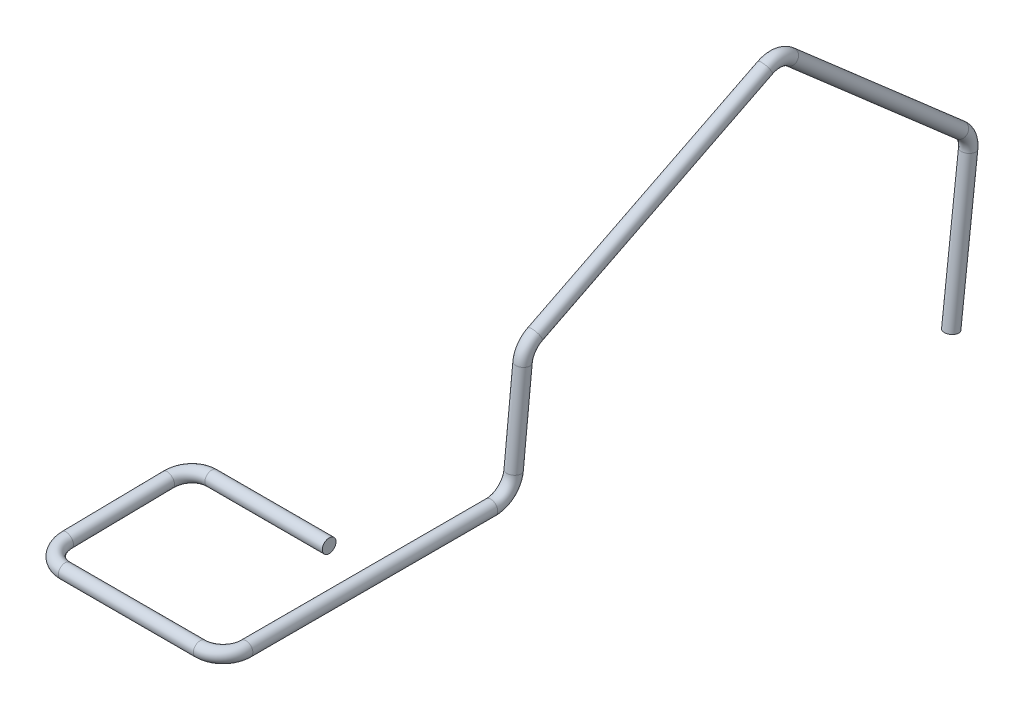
from build123d import *

# Parameters (mm, degrees)
SKETCH5_R = 0.5715


with BuildPart() as part:
    # Sweep1: sweep along a curve in space
    with BuildLine() as sweep1_path:
        Line((-2.6035, 1.3462, -11.43), (-12.37182069, 1.3462, -11.43))
        ThreePointArc((-12.37182069, 1.3462, -11.43), (-13.650565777, 1.288537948, -10.940416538), (-14.267494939, 1.14539485, -9.725050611))
        Line((-14.267494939, 1.14539485, -9.725050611), (-15.032110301, 0.244847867, -2.078896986))
        ThreePointArc((-15.032110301, 0.244847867, -2.078896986), (-14.548468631, 0.073252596, -0.621956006), (-13.136436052, 0, 0))
        Line((-13.136436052, 0, 0), (-1.905, 0, 0))
        ThreePointArc((-1.905, 0, 0), (-0.557961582, 0, -0.557961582), (0, 0, -1.905))
        Line((0, 0, -1.905), (0, 0, -22.278998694))
        ThreePointArc((0, 0, -22.278998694), (0, 0.492532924, -23.55726383), (0, 1.715445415, -24.174544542))
        Line((0, 1.715445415, -24.174544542), (0, 9.118188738, -24.914818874))
        ThreePointArc((0, 9.118188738, -24.914818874), (0, 10.007754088, -25.2404841), (0, 10.630474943, -25.954348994))
        Line((0, 10.630474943, -25.954348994), (0, 20.252883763, -45.084614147))
        ThreePointArc((0, 20.252883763, -45.084614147), (0, 20.441049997, -46.179163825), (0, 19.986834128, -47.192639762))
        Line((0, 19.986834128, -47.192639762), (0, 7.642757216, -61.348691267))
        ThreePointArc((0, 7.642757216, -61.348691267), (0, 6.895733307, -61.872807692), (0, 5.990659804, -61.98936112))
        Line((0, 5.990659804, -61.98936112), (0, -6.35, -60.579))
    # Sketch5 → Sweep1 (sweep)
    with BuildSketch(Plane(origin=(-2.6035, 1.3462, -11.43), x_dir=(0, 0, -1), z_dir=(1, 0, 0))):
        Circle(SKETCH5_R)
    sweep(path=sweep1_path.line)


solid = part.part
